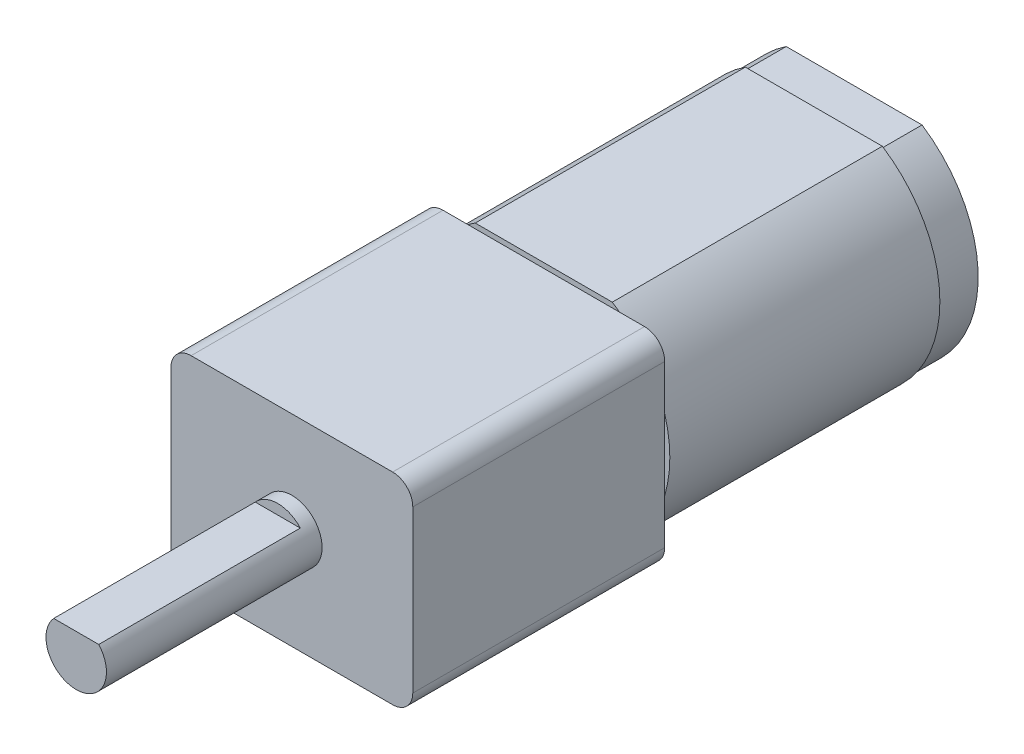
ISO-10303-21;
HEADER;
FILE_DESCRIPTION(('STEP AP214'),'2;1');
FILE_NAME('part.step','',(''),(''),'','','');
FILE_SCHEMA(('AUTOMOTIVE_DESIGN { 1 0 10303 214 1 1 1 1 }'));
ENDSEC;
DATA;
#1=APPLICATION_CONTEXT('core data for automotive mechanical design processes');
#2=APPLICATION_PROTOCOL_DEFINITION('international standard','automotive_design',2000,#1);
#3=PRODUCT_CONTEXT('',#1,'mechanical');
#4=PRODUCT('Part','Part','',(#3));
#5=PRODUCT_RELATED_PRODUCT_CATEGORY('part','',(#4));
#6=PRODUCT_DEFINITION_FORMATION('','',#4);
#7=PRODUCT_DEFINITION_CONTEXT('part definition',#1,'design');
#8=PRODUCT_DEFINITION('design','',#6,#7);
#9=PRODUCT_DEFINITION_SHAPE('','',#8);
#10=(LENGTH_UNIT() NAMED_UNIT(*) SI_UNIT(.MILLI.,.METRE.));
#11=(NAMED_UNIT(*) PLANE_ANGLE_UNIT() SI_UNIT($,.RADIAN.));
#12=(NAMED_UNIT(*) SI_UNIT($,.STERADIAN.) SOLID_ANGLE_UNIT());
#13=UNCERTAINTY_MEASURE_WITH_UNIT(LENGTH_MEASURE(1.E-05),#10,'distance_accuracy_value','');
#14=(GEOMETRIC_REPRESENTATION_CONTEXT(3) GLOBAL_UNCERTAINTY_ASSIGNED_CONTEXT((#13)) GLOBAL_UNIT_ASSIGNED_CONTEXT((#10,
#11,#12)) REPRESENTATION_CONTEXT('',''));
#15=CARTESIAN_POINT('',(0.,0.,0.));
#16=DIRECTION('',(0.,0.,1.));
#17=DIRECTION('',(1.,0.,0.));
#18=AXIS2_PLACEMENT_3D('',#15,#16,#17);
#19=CARTESIAN_POINT('',(0.,0.,-25.9));
#20=DIRECTION('',(0.,0.,-1.));
#21=DIRECTION('',(-1.,0.,0.));
#22=AXIS2_PLACEMENT_3D('',#19,#20,#21);
#23=PLANE('',#22);
#24=CARTESIAN_POINT('',(0.,0.,-25.9));
#25=DIRECTION('',(0.,0.,-1.));
#26=DIRECTION('',(-1.,0.,0.));
#27=AXIS2_PLACEMENT_3D('',#24,#25,#26);
#28=CIRCLE('',#27,6.25433398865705);
#29=CARTESIAN_POINT('',(3.39914601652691,5.25,-25.9));
#30=VERTEX_POINT('',#29);
#31=CARTESIAN_POINT('',(3.39914601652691,-5.25,-25.9));
#32=VERTEX_POINT('',#31);
#33=EDGE_CURVE('E231',#30,#32,#28,.T.);
#34=ORIENTED_EDGE('',*,*,#33,.T.);
#35=DIRECTION('',(-1.,0.,0.));
#36=VECTOR('',#35,1.);
#37=CARTESIAN_POINT('',(3.39914601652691,-5.25,-25.9));
#38=LINE('',#37,#36);
#39=CARTESIAN_POINT('',(-3.39914601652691,-5.25,-25.9));
#40=VERTEX_POINT('',#39);
#41=EDGE_CURVE('E234',#32,#40,#38,.T.);
#42=ORIENTED_EDGE('',*,*,#41,.T.);
#43=CARTESIAN_POINT('',(0.,0.,-25.9));
#44=DIRECTION('',(0.,0.,-1.));
#45=DIRECTION('',(-1.,0.,0.));
#46=AXIS2_PLACEMENT_3D('',#43,#44,#45);
#47=CIRCLE('',#46,6.25433398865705);
#48=CARTESIAN_POINT('',(-3.39914601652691,5.25,-25.9));
#49=VERTEX_POINT('',#48);
#50=EDGE_CURVE('E236',#40,#49,#47,.T.);
#51=ORIENTED_EDGE('',*,*,#50,.T.);
#52=DIRECTION('',(1.,0.,0.));
#53=VECTOR('',#52,1.);
#54=CARTESIAN_POINT('',(3.39914601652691,5.25,-25.9));
#55=LINE('',#54,#53);
#56=EDGE_CURVE('E238',#49,#30,#55,.T.);
#57=ORIENTED_EDGE('',*,*,#56,.T.);
#58=EDGE_LOOP('',(#34,#42,#51,#57));
#59=FACE_BOUND('',#58,.T.);
#60=DIRECTION('',(-1.,0.,0.));
#61=VECTOR('',#60,1.);
#62=CARTESIAN_POINT('',(3.36946981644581,-5.15,-25.9));
#63=LINE('',#62,#61);
#64=CARTESIAN_POINT('',(3.36946981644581,-5.15,-25.9));
#65=VERTEX_POINT('',#64);
#66=CARTESIAN_POINT('',(-3.36946981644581,-5.15,-25.9));
#67=VERTEX_POINT('',#66);
#68=EDGE_CURVE('E184',#65,#67,#63,.T.);
#69=ORIENTED_EDGE('',*,*,#68,.F.);
#70=CARTESIAN_POINT('',(0.,0.,-25.9));
#71=DIRECTION('',(0.,0.,-1.));
#72=DIRECTION('',(-1.,0.,0.));
#73=AXIS2_PLACEMENT_3D('',#70,#71,#72);
#74=CIRCLE('',#73,6.15433398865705);
#75=CARTESIAN_POINT('',(3.36946981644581,5.15,-25.9));
#76=VERTEX_POINT('',#75);
#77=EDGE_CURVE('E195',#76,#65,#74,.T.);
#78=ORIENTED_EDGE('',*,*,#77,.F.);
#79=DIRECTION('',(1.,0.,0.));
#80=VECTOR('',#79,1.);
#81=CARTESIAN_POINT('',(-3.36946981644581,5.15,-25.9));
#82=LINE('',#81,#80);
#83=CARTESIAN_POINT('',(-3.36946981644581,5.15,-25.9));
#84=VERTEX_POINT('',#83);
#85=EDGE_CURVE('E205',#84,#76,#82,.T.);
#86=ORIENTED_EDGE('',*,*,#85,.F.);
#87=CARTESIAN_POINT('',(0.,0.,-25.9));
#88=DIRECTION('',(0.,0.,-1.));
#89=DIRECTION('',(-1.,0.,0.));
#90=AXIS2_PLACEMENT_3D('',#87,#88,#89);
#91=CIRCLE('',#90,6.15433398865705);
#92=EDGE_CURVE('E203',#67,#84,#91,.T.);
#93=ORIENTED_EDGE('',*,*,#92,.F.);
#94=EDGE_LOOP('',(#69,#78,#86,#93));
#95=FACE_BOUND('',#94,.T.);
#96=ADVANCED_FACE('F27',(#59,#95),#23,.T.);
#97=CARTESIAN_POINT('',(-5.,4.,-12.5));
#98=DIRECTION('',(0.,0.,1.));
#99=DIRECTION('',(1.,0.,0.));
#100=AXIS2_PLACEMENT_3D('',#97,#98,#99);
#101=PLANE('',#100);
#102=CARTESIAN_POINT('',(0.,0.,-12.5));
#103=DIRECTION('',(0.,0.,-1.));
#104=DIRECTION('',(-1.,0.,0.));
#105=AXIS2_PLACEMENT_3D('',#102,#103,#104);
#106=CIRCLE('',#105,6.25433398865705);
#107=CARTESIAN_POINT('',(3.75721887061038,5.,-12.5));
#108=VERTEX_POINT('',#107);
#109=CARTESIAN_POINT('',(6.,1.76541599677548,-12.5));
#110=VERTEX_POINT('',#109);
#111=EDGE_CURVE('E11',#108,#110,#106,.T.);
#112=ORIENTED_EDGE('',*,*,#111,.F.);
#113=DIRECTION('',(-1.,0.,0.));
#114=VECTOR('',#113,1.);
#115=CARTESIAN_POINT('',(-4.99999999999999,5.,-12.5));
#116=LINE('',#115,#114);
#117=CARTESIAN_POINT('',(4.99999999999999,5.,-12.5));
#118=VERTEX_POINT('',#117);
#119=EDGE_CURVE('E330',#118,#108,#116,.T.);
#120=ORIENTED_EDGE('',*,*,#119,.F.);
#121=CARTESIAN_POINT('',(5.,4.,-12.5));
#122=DIRECTION('',(0.,0.,1.));
#123=DIRECTION('',(1.,0.,0.));
#124=AXIS2_PLACEMENT_3D('',#121,#122,#123);
#125=CIRCLE('',#124,1.);
#126=CARTESIAN_POINT('',(6.,3.99999999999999,-12.5));
#127=VERTEX_POINT('',#126);
#128=EDGE_CURVE('E325',#127,#118,#125,.T.);
#129=ORIENTED_EDGE('',*,*,#128,.F.);
#130=DIRECTION('',(0.,1.,0.));
#131=VECTOR('',#130,1.);
#132=CARTESIAN_POINT('',(6.,3.99999999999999,-12.5));
#133=LINE('',#132,#131);
#134=EDGE_CURVE('E321',#110,#127,#133,.T.);
#135=ORIENTED_EDGE('',*,*,#134,.F.);
#136=EDGE_LOOP('',(#112,#120,#129,#135));
#137=FACE_BOUND('',#136,.T.);
#138=ADVANCED_FACE('F406',(#137),#101,.F.);
#139=CARTESIAN_POINT('',(6.,-1.76541599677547,-12.5));
#140=VERTEX_POINT('',#139);
#141=CARTESIAN_POINT('',(3.75721887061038,-5.,-12.5));
#142=VERTEX_POINT('',#141);
#143=EDGE_CURVE('E36',#140,#142,#106,.T.);
#144=ORIENTED_EDGE('',*,*,#143,.F.);
#145=CARTESIAN_POINT('',(6.,-3.99999999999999,-12.5));
#146=VERTEX_POINT('',#145);
#147=EDGE_CURVE('E322',#146,#140,#133,.T.);
#148=ORIENTED_EDGE('',*,*,#147,.F.);
#149=CARTESIAN_POINT('',(5.,-4.,-12.5));
#150=DIRECTION('',(0.,0.,1.));
#151=DIRECTION('',(-1.,0.,0.));
#152=AXIS2_PLACEMENT_3D('',#149,#150,#151);
#153=CIRCLE('',#152,1.);
#154=CARTESIAN_POINT('',(5.,-5.,-12.5));
#155=VERTEX_POINT('',#154);
#156=EDGE_CURVE('E317',#155,#146,#153,.T.);
#157=ORIENTED_EDGE('',*,*,#156,.F.);
#158=DIRECTION('',(1.,0.,0.));
#159=VECTOR('',#158,1.);
#160=CARTESIAN_POINT('',(-4.99999999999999,-5.,-12.5));
#161=LINE('',#160,#159);
#162=EDGE_CURVE('E313',#142,#155,#161,.T.);
#163=ORIENTED_EDGE('',*,*,#162,.F.);
#164=EDGE_LOOP('',(#144,#148,#157,#163));
#165=FACE_BOUND('',#164,.T.);
#166=ADVANCED_FACE('F390',(#165),#101,.F.);
#167=CARTESIAN_POINT('',(0.,0.,-12.5));
#168=DIRECTION('',(0.,0.,-1.));
#169=DIRECTION('',(-1.,0.,0.));
#170=AXIS2_PLACEMENT_3D('',#167,#168,#169);
#171=CIRCLE('',#170,6.25433398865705);
#172=CARTESIAN_POINT('',(-3.75721887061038,-5.,-12.5));
#173=VERTEX_POINT('',#172);
#174=CARTESIAN_POINT('',(-6.,-1.76541599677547,-12.5));
#175=VERTEX_POINT('',#174);
#176=EDGE_CURVE('E379',#173,#175,#171,.T.);
#177=ORIENTED_EDGE('',*,*,#176,.F.);
#178=CARTESIAN_POINT('',(-4.99999999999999,-5.,-12.5));
#179=VERTEX_POINT('',#178);
#180=EDGE_CURVE('E314',#179,#173,#161,.T.);
#181=ORIENTED_EDGE('',*,*,#180,.F.);
#182=CARTESIAN_POINT('',(-5.,-4.,-12.5));
#183=DIRECTION('',(0.,0.,1.));
#184=DIRECTION('',(1.,0.,0.));
#185=AXIS2_PLACEMENT_3D('',#182,#183,#184);
#186=CIRCLE('',#185,1.);
#187=CARTESIAN_POINT('',(-6.,-3.99999999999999,-12.5));
#188=VERTEX_POINT('',#187);
#189=EDGE_CURVE('E309',#188,#179,#186,.T.);
#190=ORIENTED_EDGE('',*,*,#189,.F.);
#191=DIRECTION('',(0.,-1.,0.));
#192=VECTOR('',#191,1.);
#193=CARTESIAN_POINT('',(-6.,3.99999999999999,-12.5));
#194=LINE('',#193,#192);
#195=EDGE_CURVE('E53',#175,#188,#194,.T.);
#196=ORIENTED_EDGE('',*,*,#195,.F.);
#197=EDGE_LOOP('',(#177,#181,#190,#196));
#198=FACE_BOUND('',#197,.T.);
#199=ADVANCED_FACE('F436',(#198),#101,.F.);
#200=CARTESIAN_POINT('',(-6.,1.76541599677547,-12.5));
#201=VERTEX_POINT('',#200);
#202=CARTESIAN_POINT('',(-3.75721887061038,5.,-12.5));
#203=VERTEX_POINT('',#202);
#204=EDGE_CURVE('E229',#201,#203,#171,.T.);
#205=ORIENTED_EDGE('',*,*,#204,.F.);
#206=CARTESIAN_POINT('',(-6.,3.99999999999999,-12.5));
#207=VERTEX_POINT('',#206);
#208=EDGE_CURVE('E306',#207,#201,#194,.T.);
#209=ORIENTED_EDGE('',*,*,#208,.F.);
#210=CARTESIAN_POINT('',(-5.,4.,-12.5));
#211=DIRECTION('',(0.,0.,1.));
#212=DIRECTION('',(1.,0.,0.));
#213=AXIS2_PLACEMENT_3D('',#210,#211,#212);
#214=CIRCLE('',#213,1.);
#215=CARTESIAN_POINT('',(-4.99999999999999,5.,-12.5));
#216=VERTEX_POINT('',#215);
#217=EDGE_CURVE('E303',#216,#207,#214,.T.);
#218=ORIENTED_EDGE('',*,*,#217,.F.);
#219=EDGE_CURVE('E329',#203,#216,#116,.T.);
#220=ORIENTED_EDGE('',*,*,#219,.F.);
#221=EDGE_LOOP('',(#205,#209,#218,#220));
#222=FACE_BOUND('',#221,.T.);
#223=ADVANCED_FACE('F368',(#222),#101,.F.);
#224=CARTESIAN_POINT('',(-5.,4.,0.));
#225=DIRECTION('',(0.,0.,1.));
#226=DIRECTION('',(1.,0.,0.));
#227=AXIS2_PLACEMENT_3D('',#224,#225,#226);
#228=PLANE('',#227);
#229=CARTESIAN_POINT('',(-5.,4.,0.));
#230=DIRECTION('',(0.,0.,1.));
#231=DIRECTION('',(1.,0.,0.));
#232=AXIS2_PLACEMENT_3D('',#229,#230,#231);
#233=CIRCLE('',#232,1.);
#234=CARTESIAN_POINT('',(-4.99999999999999,5.,0.));
#235=VERTEX_POINT('',#234);
#236=CARTESIAN_POINT('',(-6.,3.99999999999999,0.));
#237=VERTEX_POINT('',#236);
#238=EDGE_CURVE('E278',#235,#237,#233,.T.);
#239=ORIENTED_EDGE('',*,*,#238,.T.);
#240=DIRECTION('',(0.,-1.,0.));
#241=VECTOR('',#240,1.);
#242=CARTESIAN_POINT('',(-6.,3.99999999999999,0.));
#243=LINE('',#242,#241);
#244=CARTESIAN_POINT('',(-6.,-3.99999999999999,0.));
#245=VERTEX_POINT('',#244);
#246=EDGE_CURVE('E282',#237,#245,#243,.T.);
#247=ORIENTED_EDGE('',*,*,#246,.T.);
#248=CARTESIAN_POINT('',(-5.,-4.,0.));
#249=DIRECTION('',(0.,0.,1.));
#250=DIRECTION('',(1.,0.,0.));
#251=AXIS2_PLACEMENT_3D('',#248,#249,#250);
#252=CIRCLE('',#251,1.);
#253=CARTESIAN_POINT('',(-4.99999999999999,-5.,0.));
#254=VERTEX_POINT('',#253);
#255=EDGE_CURVE('E285',#245,#254,#252,.T.);
#256=ORIENTED_EDGE('',*,*,#255,.T.);
#257=DIRECTION('',(1.,0.,0.));
#258=VECTOR('',#257,1.);
#259=CARTESIAN_POINT('',(-4.99999999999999,-5.,0.));
#260=LINE('',#259,#258);
#261=CARTESIAN_POINT('',(5.,-5.,0.));
#262=VERTEX_POINT('',#261);
#263=EDGE_CURVE('E288',#254,#262,#260,.T.);
#264=ORIENTED_EDGE('',*,*,#263,.T.);
#265=CARTESIAN_POINT('',(5.,-4.,0.));
#266=DIRECTION('',(0.,0.,1.));
#267=DIRECTION('',(-1.,0.,0.));
#268=AXIS2_PLACEMENT_3D('',#265,#266,#267);
#269=CIRCLE('',#268,1.);
#270=CARTESIAN_POINT('',(6.,-3.99999999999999,0.));
#271=VERTEX_POINT('',#270);
#272=EDGE_CURVE('E291',#262,#271,#269,.T.);
#273=ORIENTED_EDGE('',*,*,#272,.T.);
#274=DIRECTION('',(0.,1.,0.));
#275=VECTOR('',#274,1.);
#276=CARTESIAN_POINT('',(6.,3.99999999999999,0.));
#277=LINE('',#276,#275);
#278=CARTESIAN_POINT('',(6.,3.99999999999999,0.));
#279=VERTEX_POINT('',#278);
#280=EDGE_CURVE('E294',#271,#279,#277,.T.);
#281=ORIENTED_EDGE('',*,*,#280,.T.);
#282=CARTESIAN_POINT('',(5.,4.,0.));
#283=DIRECTION('',(0.,0.,1.));
#284=DIRECTION('',(1.,0.,0.));
#285=AXIS2_PLACEMENT_3D('',#282,#283,#284);
#286=CIRCLE('',#285,1.);
#287=CARTESIAN_POINT('',(4.99999999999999,5.,0.));
#288=VERTEX_POINT('',#287);
#289=EDGE_CURVE('E297',#279,#288,#286,.T.);
#290=ORIENTED_EDGE('',*,*,#289,.T.);
#291=DIRECTION('',(-1.,0.,0.));
#292=VECTOR('',#291,1.);
#293=CARTESIAN_POINT('',(-4.99999999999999,5.,0.));
#294=LINE('',#293,#292);
#295=EDGE_CURVE('E300',#288,#235,#294,.T.);
#296=ORIENTED_EDGE('',*,*,#295,.T.);
#297=EDGE_LOOP('',(#239,#247,#256,#264,#273,#281,#290,#296));
#298=FACE_BOUND('',#297,.T.);
#299=CARTESIAN_POINT('',(0.,0.,0.));
#300=DIRECTION('',(0.,0.,1.));
#301=DIRECTION('',(1.,0.,0.));
#302=AXIS2_PLACEMENT_3D('',#299,#300,#301);
#303=CIRCLE('',#302,1.5);
#304=CARTESIAN_POINT('',(1.5,0.,0.));
#305=VERTEX_POINT('',#304);
#306=EDGE_CURVE('E270',#305,#305,#303,.T.);
#307=ORIENTED_EDGE('',*,*,#306,.F.);
#308=EDGE_LOOP('',(#307));
#309=FACE_BOUND('',#308,.T.);
#310=ADVANCED_FACE('F360',(#298,#309),#228,.T.);
#311=CARTESIAN_POINT('',(-5.,4.,-12.5));
#312=DIRECTION('',(0.,0.,1.));
#313=DIRECTION('',(1.,0.,0.));
#314=AXIS2_PLACEMENT_3D('',#311,#312,#313);
#315=CYLINDRICAL_SURFACE('',#314,1.);
#316=ORIENTED_EDGE('',*,*,#238,.F.);
#317=DIRECTION('',(0.,0.,1.));
#318=VECTOR('',#317,1.);
#319=CARTESIAN_POINT('',(-4.99999999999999,5.,-12.5));
#320=LINE('',#319,#318);
#321=EDGE_CURVE('E335',#216,#235,#320,.T.);
#322=ORIENTED_EDGE('',*,*,#321,.F.);
#323=ORIENTED_EDGE('',*,*,#217,.T.);
#324=DIRECTION('',(0.,0.,1.));
#325=VECTOR('',#324,1.);
#326=CARTESIAN_POINT('',(-6.,3.99999999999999,-12.5));
#327=LINE('',#326,#325);
#328=EDGE_CURVE('E333',#207,#237,#327,.T.);
#329=ORIENTED_EDGE('',*,*,#328,.T.);
#330=EDGE_LOOP('',(#316,#322,#323,#329));
#331=FACE_BOUND('',#330,.T.);
#332=ADVANCED_FACE('F29',(#331),#315,.T.);
#333=CARTESIAN_POINT('',(-4.99999999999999,5.,-12.5));
#334=DIRECTION('',(0.,1.,0.));
#335=DIRECTION('',(0.,0.,1.));
#336=AXIS2_PLACEMENT_3D('',#333,#334,#335);
#337=PLANE('',#336);
#338=ORIENTED_EDGE('',*,*,#295,.F.);
#339=DIRECTION('',(0.,0.,1.));
#340=VECTOR('',#339,1.);
#341=CARTESIAN_POINT('',(4.99999999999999,5.,-12.5));
#342=LINE('',#341,#340);
#343=EDGE_CURVE('E337',#118,#288,#342,.T.);
#344=ORIENTED_EDGE('',*,*,#343,.F.);
#345=ORIENTED_EDGE('',*,*,#119,.T.);
#346=EDGE_CURVE('E334',#108,#203,#116,.T.);
#347=ORIENTED_EDGE('',*,*,#346,.T.);
#348=ORIENTED_EDGE('',*,*,#219,.T.);
#349=ORIENTED_EDGE('',*,*,#321,.T.);
#350=EDGE_LOOP('',(#338,#344,#345,#347,#348,#349));
#351=FACE_BOUND('',#350,.T.);
#352=ADVANCED_FACE('F365',(#351),#337,.T.);
#353=CARTESIAN_POINT('',(5.,4.,-12.5));
#354=DIRECTION('',(0.,0.,1.));
#355=DIRECTION('',(1.,0.,0.));
#356=AXIS2_PLACEMENT_3D('',#353,#354,#355);
#357=CYLINDRICAL_SURFACE('',#356,1.);
#358=ORIENTED_EDGE('',*,*,#289,.F.);
#359=DIRECTION('',(0.,0.,1.));
#360=VECTOR('',#359,1.);
#361=CARTESIAN_POINT('',(6.,3.99999999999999,-12.5));
#362=LINE('',#361,#360);
#363=EDGE_CURVE('E339',#127,#279,#362,.T.);
#364=ORIENTED_EDGE('',*,*,#363,.F.);
#365=ORIENTED_EDGE('',*,*,#128,.T.);
#366=ORIENTED_EDGE('',*,*,#343,.T.);
#367=EDGE_LOOP('',(#358,#364,#365,#366));
#368=FACE_BOUND('',#367,.T.);
#369=ADVANCED_FACE('F404',(#368),#357,.T.);
#370=CARTESIAN_POINT('',(6.,3.99999999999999,-12.5));
#371=DIRECTION('',(1.,0.,0.));
#372=DIRECTION('',(0.,1.,0.));
#373=AXIS2_PLACEMENT_3D('',#370,#371,#372);
#374=PLANE('',#373);
#375=ORIENTED_EDGE('',*,*,#280,.F.);
#376=DIRECTION('',(0.,0.,1.));
#377=VECTOR('',#376,1.);
#378=CARTESIAN_POINT('',(6.,-3.99999999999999,-12.5));
#379=LINE('',#378,#377);
#380=EDGE_CURVE('E341',#146,#271,#379,.T.);
#381=ORIENTED_EDGE('',*,*,#380,.F.);
#382=ORIENTED_EDGE('',*,*,#147,.T.);
#383=EDGE_CURVE('E326',#140,#110,#133,.T.);
#384=ORIENTED_EDGE('',*,*,#383,.T.);
#385=ORIENTED_EDGE('',*,*,#134,.T.);
#386=ORIENTED_EDGE('',*,*,#363,.T.);
#387=EDGE_LOOP('',(#375,#381,#382,#384,#385,#386));
#388=FACE_BOUND('',#387,.T.);
#389=ADVANCED_FACE('F397',(#388),#374,.T.);
#390=CARTESIAN_POINT('',(5.,-4.,-12.5));
#391=DIRECTION('',(0.,0.,1.));
#392=DIRECTION('',(1.,0.,0.));
#393=AXIS2_PLACEMENT_3D('',#390,#391,#392);
#394=CYLINDRICAL_SURFACE('',#393,1.);
#395=ORIENTED_EDGE('',*,*,#272,.F.);
#396=DIRECTION('',(0.,0.,1.));
#397=VECTOR('',#396,1.);
#398=CARTESIAN_POINT('',(5.,-5.,-12.5));
#399=LINE('',#398,#397);
#400=EDGE_CURVE('E343',#155,#262,#399,.T.);
#401=ORIENTED_EDGE('',*,*,#400,.F.);
#402=ORIENTED_EDGE('',*,*,#156,.T.);
#403=ORIENTED_EDGE('',*,*,#380,.T.);
#404=EDGE_LOOP('',(#395,#401,#402,#403));
#405=FACE_BOUND('',#404,.T.);
#406=ADVANCED_FACE('F433',(#405),#394,.T.);
#407=CARTESIAN_POINT('',(-4.99999999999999,-5.,-12.5));
#408=DIRECTION('',(0.,-1.,0.));
#409=DIRECTION('',(0.,0.,-1.));
#410=AXIS2_PLACEMENT_3D('',#407,#408,#409);
#411=PLANE('',#410);
#412=ORIENTED_EDGE('',*,*,#263,.F.);
#413=DIRECTION('',(0.,0.,1.));
#414=VECTOR('',#413,1.);
#415=CARTESIAN_POINT('',(-4.99999999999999,-5.,-12.5));
#416=LINE('',#415,#414);
#417=EDGE_CURVE('E345',#179,#254,#416,.T.);
#418=ORIENTED_EDGE('',*,*,#417,.F.);
#419=ORIENTED_EDGE('',*,*,#180,.T.);
#420=EDGE_CURVE('E318',#173,#142,#161,.T.);
#421=ORIENTED_EDGE('',*,*,#420,.T.);
#422=ORIENTED_EDGE('',*,*,#162,.T.);
#423=ORIENTED_EDGE('',*,*,#400,.T.);
#424=EDGE_LOOP('',(#412,#418,#419,#421,#422,#423));
#425=FACE_BOUND('',#424,.T.);
#426=ADVANCED_FACE('F430',(#425),#411,.T.);
#427=CARTESIAN_POINT('',(-5.,-4.,-12.5));
#428=DIRECTION('',(0.,0.,1.));
#429=DIRECTION('',(1.,0.,0.));
#430=AXIS2_PLACEMENT_3D('',#427,#428,#429);
#431=CYLINDRICAL_SURFACE('',#430,1.);
#432=ORIENTED_EDGE('',*,*,#255,.F.);
#433=DIRECTION('',(0.,0.,1.));
#434=VECTOR('',#433,1.);
#435=CARTESIAN_POINT('',(-6.,-3.99999999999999,-12.5));
#436=LINE('',#435,#434);
#437=EDGE_CURVE('E347',#188,#245,#436,.T.);
#438=ORIENTED_EDGE('',*,*,#437,.F.);
#439=ORIENTED_EDGE('',*,*,#189,.T.);
#440=ORIENTED_EDGE('',*,*,#417,.T.);
#441=EDGE_LOOP('',(#432,#438,#439,#440));
#442=FACE_BOUND('',#441,.T.);
#443=ADVANCED_FACE('F437',(#442),#431,.T.);
#444=CARTESIAN_POINT('',(-6.,3.99999999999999,-12.5));
#445=DIRECTION('',(-1.,0.,0.));
#446=DIRECTION('',(0.,-1.,0.));
#447=AXIS2_PLACEMENT_3D('',#444,#445,#446);
#448=PLANE('',#447);
#449=ORIENTED_EDGE('',*,*,#246,.F.);
#450=ORIENTED_EDGE('',*,*,#328,.F.);
#451=ORIENTED_EDGE('',*,*,#208,.T.);
#452=EDGE_CURVE('E310',#201,#175,#194,.T.);
#453=ORIENTED_EDGE('',*,*,#452,.T.);
#454=ORIENTED_EDGE('',*,*,#195,.T.);
#455=ORIENTED_EDGE('',*,*,#437,.T.);
#456=EDGE_LOOP('',(#449,#450,#451,#453,#454,#455));
#457=FACE_BOUND('',#456,.T.);
#458=ADVANCED_FACE('F356',(#457),#448,.T.);
#459=CARTESIAN_POINT('',(0.,0.,0.7));
#460=DIRECTION('',(0.,0.,-1.));
#461=DIRECTION('',(-1.,0.,0.));
#462=AXIS2_PLACEMENT_3D('',#459,#460,#461);
#463=CYLINDRICAL_SURFACE('',#462,1.5);
#464=CARTESIAN_POINT('',(0.,0.,0.7));
#465=DIRECTION('',(0.,0.,1.));
#466=DIRECTION('',(1.,0.,0.));
#467=AXIS2_PLACEMENT_3D('',#464,#465,#466);
#468=CIRCLE('',#467,1.5);
#469=CARTESIAN_POINT('',(1.1180339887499,1.,0.7));
#470=VERTEX_POINT('',#469);
#471=CARTESIAN_POINT('',(-1.1180339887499,1.,0.7));
#472=VERTEX_POINT('',#471);
#473=EDGE_CURVE('E274',#470,#472,#468,.T.);
#474=ORIENTED_EDGE('',*,*,#473,.F.);
#475=DIRECTION('',(0.,0.,-1.));
#476=VECTOR('',#475,1.);
#477=CARTESIAN_POINT('',(1.1180339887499,1.,10.7));
#478=LINE('',#477,#476);
#479=CARTESIAN_POINT('',(1.1180339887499,1.,10.7));
#480=VERTEX_POINT('',#479);
#481=EDGE_CURVE('E266',#480,#470,#478,.T.);
#482=ORIENTED_EDGE('',*,*,#481,.F.);
#483=CARTESIAN_POINT('',(0.,0.,10.7));
#484=DIRECTION('',(0.,0.,1.));
#485=DIRECTION('',(-1.,0.,0.));
#486=AXIS2_PLACEMENT_3D('',#483,#484,#485);
#487=CIRCLE('',#486,1.5);
#488=CARTESIAN_POINT('',(-1.1180339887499,1.,10.7));
#489=VERTEX_POINT('',#488);
#490=EDGE_CURVE('E255',#489,#480,#487,.T.);
#491=ORIENTED_EDGE('',*,*,#490,.F.);
#492=DIRECTION('',(0.,0.,-1.));
#493=VECTOR('',#492,1.);
#494=CARTESIAN_POINT('',(-1.1180339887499,1.,10.7));
#495=LINE('',#494,#493);
#496=EDGE_CURVE('E263',#489,#472,#495,.T.);
#497=ORIENTED_EDGE('',*,*,#496,.T.);
#498=EDGE_LOOP('',(#474,#482,#491,#497));
#499=FACE_BOUND('',#498,.T.);
#500=ORIENTED_EDGE('',*,*,#306,.T.);
#501=EDGE_LOOP('',(#500));
#502=FACE_BOUND('',#501,.T.);
#503=ADVANCED_FACE('F445',(#499,#502),#463,.T.);
#504=CARTESIAN_POINT('',(0.,0.,0.7));
#505=DIRECTION('',(0.,0.,1.));
#506=DIRECTION('',(1.,0.,0.));
#507=AXIS2_PLACEMENT_3D('',#504,#505,#506);
#508=PLANE('',#507);
#509=DIRECTION('',(-1.,0.,0.));
#510=VECTOR('',#509,1.);
#511=CARTESIAN_POINT('',(-1.1180339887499,1.,0.7));
#512=LINE('',#511,#510);
#513=EDGE_CURVE('E252',#470,#472,#512,.T.);
#514=ORIENTED_EDGE('',*,*,#513,.F.);
#515=ORIENTED_EDGE('',*,*,#473,.T.);
#516=EDGE_LOOP('',(#514,#515));
#517=FACE_BOUND('',#516,.T.);
#518=ADVANCED_FACE('F474',(#517),#508,.T.);
#519=CARTESIAN_POINT('',(-1.1180339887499,1.,10.7));
#520=DIRECTION('',(0.,-1.,0.));
#521=DIRECTION('',(0.,0.,-1.));
#522=AXIS2_PLACEMENT_3D('',#519,#520,#521);
#523=PLANE('',#522);
#524=ORIENTED_EDGE('',*,*,#513,.T.);
#525=ORIENTED_EDGE('',*,*,#496,.F.);
#526=DIRECTION('',(-1.,0.,0.));
#527=VECTOR('',#526,1.);
#528=CARTESIAN_POINT('',(-1.1180339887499,1.,10.7));
#529=LINE('',#528,#527);
#530=EDGE_CURVE('E267',#480,#489,#529,.T.);
#531=ORIENTED_EDGE('',*,*,#530,.F.);
#532=ORIENTED_EDGE('',*,*,#481,.T.);
#533=EDGE_LOOP('',(#524,#525,#531,#532));
#534=FACE_BOUND('',#533,.T.);
#535=ADVANCED_FACE('F470',(#534),#523,.F.);
#536=CARTESIAN_POINT('',(0.,0.,10.7));
#537=DIRECTION('',(0.,0.,-1.));
#538=DIRECTION('',(-1.,0.,0.));
#539=AXIS2_PLACEMENT_3D('',#536,#537,#538);
#540=PLANE('',#539);
#541=ORIENTED_EDGE('',*,*,#490,.T.);
#542=ORIENTED_EDGE('',*,*,#530,.T.);
#543=EDGE_LOOP('',(#541,#542));
#544=FACE_BOUND('',#543,.T.);
#545=ADVANCED_FACE('F467',(#544),#540,.F.);
#546=CARTESIAN_POINT('',(0.,0.,-12.5));
#547=DIRECTION('',(0.,0.,-1.));
#548=DIRECTION('',(-1.,0.,0.));
#549=AXIS2_PLACEMENT_3D('',#546,#547,#548);
#550=PLANE('',#549);
#551=ORIENTED_EDGE('',*,*,#346,.F.);
#552=CARTESIAN_POINT('',(3.39914601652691,5.25,-12.5));
#553=VERTEX_POINT('',#552);
#554=EDGE_CURVE('E218',#553,#108,#106,.T.);
#555=ORIENTED_EDGE('',*,*,#554,.F.);
#556=DIRECTION('',(1.,0.,0.));
#557=VECTOR('',#556,1.);
#558=CARTESIAN_POINT('',(3.39914601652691,5.25,-12.5));
#559=LINE('',#558,#557);
#560=CARTESIAN_POINT('',(-3.39914601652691,5.25,-12.5));
#561=VERTEX_POINT('',#560);
#562=EDGE_CURVE('E227',#561,#553,#559,.T.);
#563=ORIENTED_EDGE('',*,*,#562,.F.);
#564=EDGE_CURVE('E223',#203,#561,#171,.T.);
#565=ORIENTED_EDGE('',*,*,#564,.F.);
#566=EDGE_LOOP('',(#551,#555,#563,#565));
#567=FACE_BOUND('',#566,.T.);
#568=ADVANCED_FACE('F410',(#567),#550,.F.);
#569=ORIENTED_EDGE('',*,*,#383,.F.);
#570=EDGE_CURVE('E38',#110,#140,#106,.T.);
#571=ORIENTED_EDGE('',*,*,#570,.F.);
#572=EDGE_LOOP('',(#569,#571));
#573=FACE_BOUND('',#572,.T.);
#574=ADVANCED_FACE('F399',(#573),#550,.F.);
#575=ORIENTED_EDGE('',*,*,#420,.F.);
#576=CARTESIAN_POINT('',(-3.39914601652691,-5.25,-12.5));
#577=VERTEX_POINT('',#576);
#578=EDGE_CURVE('E224',#577,#173,#171,.T.);
#579=ORIENTED_EDGE('',*,*,#578,.F.);
#580=DIRECTION('',(-1.,0.,0.));
#581=VECTOR('',#580,1.);
#582=CARTESIAN_POINT('',(3.39914601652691,-5.25,-12.5));
#583=LINE('',#582,#581);
#584=CARTESIAN_POINT('',(3.39914601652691,-5.25,-12.5));
#585=VERTEX_POINT('',#584);
#586=EDGE_CURVE('E221',#585,#577,#583,.T.);
#587=ORIENTED_EDGE('',*,*,#586,.F.);
#588=EDGE_CURVE('E190',#142,#585,#106,.T.);
#589=ORIENTED_EDGE('',*,*,#588,.F.);
#590=EDGE_LOOP('',(#575,#579,#587,#589));
#591=FACE_BOUND('',#590,.T.);
#592=ADVANCED_FACE('F426',(#591),#550,.F.);
#593=CARTESIAN_POINT('',(0.,0.,-25.9));
#594=DIRECTION('',(0.,0.,1.));
#595=DIRECTION('',(1.,0.,0.));
#596=AXIS2_PLACEMENT_3D('',#593,#594,#595);
#597=CYLINDRICAL_SURFACE('',#596,6.25433398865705);
#598=ORIENTED_EDGE('',*,*,#554,.T.);
#599=ORIENTED_EDGE('',*,*,#111,.T.);
#600=ORIENTED_EDGE('',*,*,#570,.T.);
#601=ORIENTED_EDGE('',*,*,#143,.T.);
#602=ORIENTED_EDGE('',*,*,#588,.T.);
#603=DIRECTION('',(0.,0.,1.));
#604=VECTOR('',#603,1.);
#605=CARTESIAN_POINT('',(3.39914601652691,-5.25,-25.9));
#606=LINE('',#605,#604);
#607=EDGE_CURVE('E249',#32,#585,#606,.T.);
#608=ORIENTED_EDGE('',*,*,#607,.F.);
#609=ORIENTED_EDGE('',*,*,#33,.F.);
#610=DIRECTION('',(0.,0.,1.));
#611=VECTOR('',#610,1.);
#612=CARTESIAN_POINT('',(3.39914601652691,5.25,-25.9));
#613=LINE('',#612,#611);
#614=EDGE_CURVE('E240',#30,#553,#613,.T.);
#615=ORIENTED_EDGE('',*,*,#614,.T.);
#616=EDGE_LOOP('',(#598,#599,#600,#601,#602,#608,#609,#615));
#617=FACE_BOUND('',#616,.T.);
#618=ADVANCED_FACE('F383',(#617),#597,.T.);
#619=CARTESIAN_POINT('',(3.39914601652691,-5.25,-25.9));
#620=DIRECTION('',(0.,1.,0.));
#621=DIRECTION('',(0.,0.,1.));
#622=AXIS2_PLACEMENT_3D('',#619,#620,#621);
#623=PLANE('',#622);
#624=ORIENTED_EDGE('',*,*,#586,.T.);
#625=DIRECTION('',(0.,0.,1.));
#626=VECTOR('',#625,1.);
#627=CARTESIAN_POINT('',(-3.39914601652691,-5.25,-25.9));
#628=LINE('',#627,#626);
#629=EDGE_CURVE('E246',#40,#577,#628,.T.);
#630=ORIENTED_EDGE('',*,*,#629,.F.);
#631=ORIENTED_EDGE('',*,*,#41,.F.);
#632=ORIENTED_EDGE('',*,*,#607,.T.);
#633=EDGE_LOOP('',(#624,#630,#631,#632));
#634=FACE_BOUND('',#633,.T.);
#635=ADVANCED_FACE('F423',(#634),#623,.F.);
#636=CARTESIAN_POINT('',(0.,0.,-25.9));
#637=DIRECTION('',(0.,0.,1.));
#638=DIRECTION('',(1.,0.,0.));
#639=AXIS2_PLACEMENT_3D('',#636,#637,#638);
#640=CYLINDRICAL_SURFACE('',#639,6.25433398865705);
#641=ORIENTED_EDGE('',*,*,#578,.T.);
#642=ORIENTED_EDGE('',*,*,#176,.T.);
#643=EDGE_CURVE('E228',#175,#201,#171,.T.);
#644=ORIENTED_EDGE('',*,*,#643,.T.);
#645=ORIENTED_EDGE('',*,*,#204,.T.);
#646=ORIENTED_EDGE('',*,*,#564,.T.);
#647=DIRECTION('',(0.,0.,1.));
#648=VECTOR('',#647,1.);
#649=CARTESIAN_POINT('',(-3.39914601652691,5.25,-25.9));
#650=LINE('',#649,#648);
#651=EDGE_CURVE('E243',#49,#561,#650,.T.);
#652=ORIENTED_EDGE('',*,*,#651,.F.);
#653=ORIENTED_EDGE('',*,*,#50,.F.);
#654=ORIENTED_EDGE('',*,*,#629,.T.);
#655=EDGE_LOOP('',(#641,#642,#644,#645,#646,#652,#653,#654));
#656=FACE_BOUND('',#655,.T.);
#657=ADVANCED_FACE('F378',(#656),#640,.T.);
#658=CARTESIAN_POINT('',(3.39914601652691,5.25,-25.9));
#659=DIRECTION('',(0.,-1.,0.));
#660=DIRECTION('',(0.,0.,-1.));
#661=AXIS2_PLACEMENT_3D('',#658,#659,#660);
#662=PLANE('',#661);
#663=ORIENTED_EDGE('',*,*,#562,.T.);
#664=ORIENTED_EDGE('',*,*,#614,.F.);
#665=ORIENTED_EDGE('',*,*,#56,.F.);
#666=ORIENTED_EDGE('',*,*,#651,.T.);
#667=EDGE_LOOP('',(#663,#664,#665,#666));
#668=FACE_BOUND('',#667,.T.);
#669=ADVANCED_FACE('F416',(#668),#662,.F.);
#670=ORIENTED_EDGE('',*,*,#452,.F.);
#671=ORIENTED_EDGE('',*,*,#643,.F.);
#672=EDGE_LOOP('',(#670,#671));
#673=FACE_BOUND('',#672,.T.);
#674=ADVANCED_FACE('F375',(#673),#550,.F.);
#675=CARTESIAN_POINT('',(0.,0.,-27.9));
#676=DIRECTION('',(0.,0.,1.));
#677=DIRECTION('',(1.,0.,0.));
#678=AXIS2_PLACEMENT_3D('',#675,#676,#677);
#679=CYLINDRICAL_SURFACE('',#678,6.15433398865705);
#680=ORIENTED_EDGE('',*,*,#77,.T.);
#681=DIRECTION('',(0.,0.,1.));
#682=VECTOR('',#681,1.);
#683=CARTESIAN_POINT('',(3.36946981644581,-5.15,-27.9));
#684=LINE('',#683,#682);
#685=CARTESIAN_POINT('',(3.36946981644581,-5.15,-27.9));
#686=VERTEX_POINT('',#685);
#687=EDGE_CURVE('E179',#686,#65,#684,.T.);
#688=ORIENTED_EDGE('',*,*,#687,.F.);
#689=CARTESIAN_POINT('',(0.,0.,-27.9));
#690=DIRECTION('',(0.,0.,-1.));
#691=DIRECTION('',(-1.,0.,0.));
#692=AXIS2_PLACEMENT_3D('',#689,#690,#691);
#693=CIRCLE('',#692,6.15433398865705);
#694=CARTESIAN_POINT('',(3.36946981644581,5.15,-27.9));
#695=VERTEX_POINT('',#694);
#696=EDGE_CURVE('E209',#695,#686,#693,.T.);
#697=ORIENTED_EDGE('',*,*,#696,.F.);
#698=DIRECTION('',(0.,0.,1.));
#699=VECTOR('',#698,1.);
#700=CARTESIAN_POINT('',(3.36946981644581,5.15,-27.9));
#701=LINE('',#700,#699);
#702=EDGE_CURVE('E198',#695,#76,#701,.T.);
#703=ORIENTED_EDGE('',*,*,#702,.T.);
#704=EDGE_LOOP('',(#680,#688,#697,#703));
#705=FACE_BOUND('',#704,.T.);
#706=ADVANCED_FACE('F196',(#705),#679,.T.);
#707=CARTESIAN_POINT('',(3.36946981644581,-5.15,-27.9));
#708=DIRECTION('',(0.,1.,0.));
#709=DIRECTION('',(-1.,0.,0.));
#710=AXIS2_PLACEMENT_3D('',#707,#708,#709);
#711=PLANE('',#710);
#712=ORIENTED_EDGE('',*,*,#68,.T.);
#713=DIRECTION('',(0.,0.,1.));
#714=VECTOR('',#713,1.);
#715=CARTESIAN_POINT('',(-3.36946981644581,-5.15,-27.9));
#716=LINE('',#715,#714);
#717=CARTESIAN_POINT('',(-3.36946981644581,-5.15,-27.9));
#718=VERTEX_POINT('',#717);
#719=EDGE_CURVE('E191',#718,#67,#716,.T.);
#720=ORIENTED_EDGE('',*,*,#719,.F.);
#721=DIRECTION('',(-1.,0.,0.));
#722=VECTOR('',#721,1.);
#723=CARTESIAN_POINT('',(3.36946981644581,-5.15,-27.9));
#724=LINE('',#723,#722);
#725=EDGE_CURVE('E186',#686,#718,#724,.T.);
#726=ORIENTED_EDGE('',*,*,#725,.F.);
#727=ORIENTED_EDGE('',*,*,#687,.T.);
#728=EDGE_LOOP('',(#712,#720,#726,#727));
#729=FACE_BOUND('',#728,.T.);
#730=ADVANCED_FACE('F181',(#729),#711,.F.);
#731=CARTESIAN_POINT('',(0.,0.,-27.9));
#732=DIRECTION('',(0.,0.,1.));
#733=DIRECTION('',(1.,0.,0.));
#734=AXIS2_PLACEMENT_3D('',#731,#732,#733);
#735=CYLINDRICAL_SURFACE('',#734,6.15433398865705);
#736=ORIENTED_EDGE('',*,*,#92,.T.);
#737=DIRECTION('',(0.,0.,1.));
#738=VECTOR('',#737,1.);
#739=CARTESIAN_POINT('',(-3.36946981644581,5.15,-27.9));
#740=LINE('',#739,#738);
#741=CARTESIAN_POINT('',(-3.36946981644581,5.15,-27.9));
#742=VERTEX_POINT('',#741);
#743=EDGE_CURVE('E45',#742,#84,#740,.T.);
#744=ORIENTED_EDGE('',*,*,#743,.F.);
#745=CARTESIAN_POINT('',(0.,0.,-27.9));
#746=DIRECTION('',(0.,0.,-1.));
#747=DIRECTION('',(-1.,0.,0.));
#748=AXIS2_PLACEMENT_3D('',#745,#746,#747);
#749=CIRCLE('',#748,6.15433398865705);
#750=EDGE_CURVE('E212',#718,#742,#749,.T.);
#751=ORIENTED_EDGE('',*,*,#750,.F.);
#752=ORIENTED_EDGE('',*,*,#719,.T.);
#753=EDGE_LOOP('',(#736,#744,#751,#752));
#754=FACE_BOUND('',#753,.T.);
#755=ADVANCED_FACE('F569',(#754),#735,.T.);
#756=CARTESIAN_POINT('',(-3.36946981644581,5.15,-27.9));
#757=DIRECTION('',(0.,-1.,0.));
#758=DIRECTION('',(0.,0.,-1.));
#759=AXIS2_PLACEMENT_3D('',#756,#757,#758);
#760=PLANE('',#759);
#761=ORIENTED_EDGE('',*,*,#85,.T.);
#762=ORIENTED_EDGE('',*,*,#702,.F.);
#763=DIRECTION('',(1.,0.,0.));
#764=VECTOR('',#763,1.);
#765=CARTESIAN_POINT('',(-3.36946981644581,5.15,-27.9));
#766=LINE('',#765,#764);
#767=EDGE_CURVE('E214',#742,#695,#766,.T.);
#768=ORIENTED_EDGE('',*,*,#767,.F.);
#769=ORIENTED_EDGE('',*,*,#743,.T.);
#770=EDGE_LOOP('',(#761,#762,#768,#769));
#771=FACE_BOUND('',#770,.T.);
#772=ADVANCED_FACE('F576',(#771),#760,.F.);
#773=CARTESIAN_POINT('',(0.,0.,-27.9));
#774=DIRECTION('',(0.,0.,-1.));
#775=DIRECTION('',(-1.,0.,0.));
#776=AXIS2_PLACEMENT_3D('',#773,#774,#775);
#777=PLANE('',#776);
#778=ORIENTED_EDGE('',*,*,#696,.T.);
#779=ORIENTED_EDGE('',*,*,#725,.T.);
#780=ORIENTED_EDGE('',*,*,#750,.T.);
#781=ORIENTED_EDGE('',*,*,#767,.T.);
#782=EDGE_LOOP('',(#778,#779,#780,#781));
#783=FACE_BOUND('',#782,.T.);
#784=ADVANCED_FACE('F584',(#783),#777,.T.);
#785=CLOSED_SHELL('',(#96,#138,#166,#199,#223,#310,#332,#352,#369,#389,#406,#426,#443,#458,#503,
#518,#535,#545,#568,#574,#592,#618,#635,#657,#669,#674,#706,#730,#755,#772,#784));
#786=MANIFOLD_SOLID_BREP('B2',#785);
#787=ADVANCED_BREP_SHAPE_REPRESENTATION('',(#18,#786),#14);
#788=SHAPE_DEFINITION_REPRESENTATION(#9,#787);
ENDSEC;
END-ISO-10303-21;
